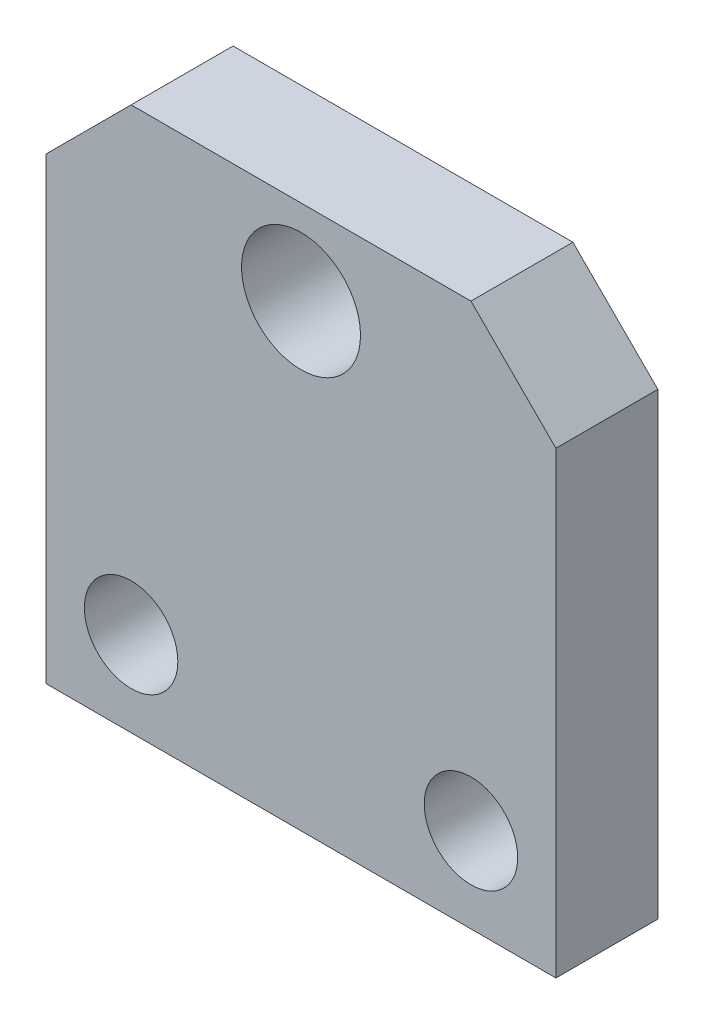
ISO-10303-21;
HEADER;
FILE_DESCRIPTION(('STEP AP214'),'2;1');
FILE_NAME('part.step','',(''),(''),'','','');
FILE_SCHEMA(('AUTOMOTIVE_DESIGN { 1 0 10303 214 1 1 1 1 }'));
ENDSEC;
DATA;
#1=APPLICATION_CONTEXT('core data for automotive mechanical design processes');
#2=APPLICATION_PROTOCOL_DEFINITION('international standard','automotive_design',2000,#1);
#3=PRODUCT_CONTEXT('',#1,'mechanical');
#4=PRODUCT('Part','Part','',(#3));
#5=PRODUCT_RELATED_PRODUCT_CATEGORY('part','',(#4));
#6=PRODUCT_DEFINITION_FORMATION('','',#4);
#7=PRODUCT_DEFINITION_CONTEXT('part definition',#1,'design');
#8=PRODUCT_DEFINITION('design','',#6,#7);
#9=PRODUCT_DEFINITION_SHAPE('','',#8);
#10=(LENGTH_UNIT() NAMED_UNIT(*) SI_UNIT(.MILLI.,.METRE.));
#11=(NAMED_UNIT(*) PLANE_ANGLE_UNIT() SI_UNIT($,.RADIAN.));
#12=(NAMED_UNIT(*) SI_UNIT($,.STERADIAN.) SOLID_ANGLE_UNIT());
#13=UNCERTAINTY_MEASURE_WITH_UNIT(LENGTH_MEASURE(1.E-05),#10,'distance_accuracy_value','');
#14=(GEOMETRIC_REPRESENTATION_CONTEXT(3) GLOBAL_UNCERTAINTY_ASSIGNED_CONTEXT((#13)) GLOBAL_UNIT_ASSIGNED_CONTEXT((#10,
#11,#12)) REPRESENTATION_CONTEXT('',''));
#15=CARTESIAN_POINT('',(0.,0.,0.));
#16=DIRECTION('',(0.,0.,1.));
#17=DIRECTION('',(1.,0.,0.));
#18=AXIS2_PLACEMENT_3D('',#15,#16,#17);
#19=CARTESIAN_POINT('',(0.,0.,8.));
#20=DIRECTION('',(0.,0.,1.));
#21=DIRECTION('',(1.,0.,0.));
#22=AXIS2_PLACEMENT_3D('',#19,#20,#21);
#23=PLANE('',#22);
#24=DIRECTION('',(0.,1.,0.));
#25=VECTOR('',#24,1.);
#26=CARTESIAN_POINT('',(-15.,16.,8.));
#27=LINE('',#26,#25);
#28=CARTESIAN_POINT('',(-15.,11.,8.));
#29=VERTEX_POINT('',#28);
#30=CARTESIAN_POINT('',(-15.,-16.,8.));
#31=VERTEX_POINT('',#30);
#32=EDGE_CURVE('E67',#29,#31,#27,.F.);
#33=ORIENTED_EDGE('',*,*,#32,.T.);
#34=DIRECTION('',(1.,0.,0.));
#35=VECTOR('',#34,1.);
#36=CARTESIAN_POINT('',(-25.,-16.,8.));
#37=LINE('',#36,#35);
#38=CARTESIAN_POINT('',(15.,-16.,8.));
#39=VERTEX_POINT('',#38);
#40=EDGE_CURVE('E262',#31,#39,#37,.T.);
#41=ORIENTED_EDGE('',*,*,#40,.T.);
#42=DIRECTION('',(0.,1.,0.));
#43=VECTOR('',#42,1.);
#44=CARTESIAN_POINT('',(15.,16.,8.));
#45=LINE('',#44,#43);
#46=CARTESIAN_POINT('',(15.,11.,8.));
#47=VERTEX_POINT('',#46);
#48=EDGE_CURVE('E268',#39,#47,#45,.T.);
#49=ORIENTED_EDGE('',*,*,#48,.T.);
#50=DIRECTION('',(0.707106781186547,-0.707106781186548,0.));
#51=VECTOR('',#50,1.);
#52=CARTESIAN_POINT('',(9.99999999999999,16.,8.));
#53=LINE('',#52,#51);
#54=CARTESIAN_POINT('',(9.99999999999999,16.,8.));
#55=VERTEX_POINT('',#54);
#56=EDGE_CURVE('E276',#47,#55,#53,.F.);
#57=ORIENTED_EDGE('',*,*,#56,.T.);
#58=DIRECTION('',(1.,0.,0.));
#59=VECTOR('',#58,1.);
#60=CARTESIAN_POINT('',(-25.,16.,8.));
#61=LINE('',#60,#59);
#62=CARTESIAN_POINT('',(-9.99999999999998,16.,8.));
#63=VERTEX_POINT('',#62);
#64=EDGE_CURVE('E72',#55,#63,#61,.F.);
#65=ORIENTED_EDGE('',*,*,#64,.T.);
#66=DIRECTION('',(0.707106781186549,0.707106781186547,0.));
#67=VECTOR('',#66,1.);
#68=CARTESIAN_POINT('',(-15.,11.,8.));
#69=LINE('',#68,#67);
#70=EDGE_CURVE('E70',#63,#29,#69,.F.);
#71=ORIENTED_EDGE('',*,*,#70,.T.);
#72=EDGE_LOOP('',(#33,#41,#49,#57,#65,#71));
#73=FACE_BOUND('',#72,.T.);
#74=CARTESIAN_POINT('',(-10.,-11.,8.));
#75=DIRECTION('',(0.,0.,1.));
#76=DIRECTION('',(1.,0.,0.));
#77=AXIS2_PLACEMENT_3D('',#74,#75,#76);
#78=CIRCLE('',#77,2.75);
#79=CARTESIAN_POINT('',(-7.25,-11.,8.));
#80=VERTEX_POINT('',#79);
#81=EDGE_CURVE('E78',#80,#80,#78,.F.);
#82=ORIENTED_EDGE('',*,*,#81,.T.);
#83=EDGE_LOOP('',(#82));
#84=FACE_BOUND('',#83,.T.);
#85=CARTESIAN_POINT('',(10.,-11.,8.));
#86=DIRECTION('',(0.,0.,1.));
#87=DIRECTION('',(1.,0.,0.));
#88=AXIS2_PLACEMENT_3D('',#85,#86,#87);
#89=CIRCLE('',#88,2.75);
#90=CARTESIAN_POINT('',(12.75,-11.,8.));
#91=VERTEX_POINT('',#90);
#92=EDGE_CURVE('E103',#91,#91,#89,.F.);
#93=ORIENTED_EDGE('',*,*,#92,.T.);
#94=EDGE_LOOP('',(#93));
#95=FACE_BOUND('',#94,.T.);
#96=CARTESIAN_POINT('',(0.,11.,8.));
#97=DIRECTION('',(0.,0.,1.));
#98=DIRECTION('',(1.,0.,0.));
#99=AXIS2_PLACEMENT_3D('',#96,#97,#98);
#100=CIRCLE('',#99,3.5);
#101=CARTESIAN_POINT('',(3.5,11.,8.));
#102=VERTEX_POINT('',#101);
#103=EDGE_CURVE('E20',#102,#102,#100,.F.);
#104=ORIENTED_EDGE('',*,*,#103,.T.);
#105=EDGE_LOOP('',(#104));
#106=FACE_BOUND('',#105,.T.);
#107=ADVANCED_FACE('F17',(#73,#84,#95,#106),#23,.T.);
#108=CARTESIAN_POINT('',(0.,11.,8.));
#109=DIRECTION('',(0.,0.,1.));
#110=DIRECTION('',(1.,0.,0.));
#111=AXIS2_PLACEMENT_3D('',#108,#109,#110);
#112=CYLINDRICAL_SURFACE('',#111,3.5);
#113=CARTESIAN_POINT('',(0.,11.,2.));
#114=DIRECTION('',(0.,0.,1.));
#115=DIRECTION('',(1.,0.,0.));
#116=AXIS2_PLACEMENT_3D('',#113,#114,#115);
#117=CIRCLE('',#116,3.5);
#118=CARTESIAN_POINT('',(3.5,11.,2.));
#119=VERTEX_POINT('',#118);
#120=EDGE_CURVE('E99',#119,#119,#117,.F.);
#121=ORIENTED_EDGE('',*,*,#120,.T.);
#122=EDGE_LOOP('',(#121));
#123=FACE_BOUND('',#122,.T.);
#124=ORIENTED_EDGE('',*,*,#103,.F.);
#125=EDGE_LOOP('',(#124));
#126=FACE_BOUND('',#125,.T.);
#127=ADVANCED_FACE('F111',(#123,#126),#112,.F.);
#128=CARTESIAN_POINT('',(10.,-11.,2.));
#129=DIRECTION('',(0.,0.,1.));
#130=DIRECTION('',(1.,0.,0.));
#131=AXIS2_PLACEMENT_3D('',#128,#129,#130);
#132=CYLINDRICAL_SURFACE('',#131,2.75);
#133=CARTESIAN_POINT('',(10.,-11.,2.));
#134=DIRECTION('',(0.,0.,1.));
#135=DIRECTION('',(1.,0.,0.));
#136=AXIS2_PLACEMENT_3D('',#133,#134,#135);
#137=CIRCLE('',#136,2.75);
#138=CARTESIAN_POINT('',(12.75,-11.,2.));
#139=VERTEX_POINT('',#138);
#140=EDGE_CURVE('E96',#139,#139,#137,.F.);
#141=ORIENTED_EDGE('',*,*,#140,.T.);
#142=EDGE_LOOP('',(#141));
#143=FACE_BOUND('',#142,.T.);
#144=ORIENTED_EDGE('',*,*,#92,.F.);
#145=EDGE_LOOP('',(#144));
#146=FACE_BOUND('',#145,.T.);
#147=ADVANCED_FACE('F113',(#143,#146),#132,.F.);
#148=CARTESIAN_POINT('',(-10.,-11.,2.));
#149=DIRECTION('',(0.,0.,1.));
#150=DIRECTION('',(1.,0.,0.));
#151=AXIS2_PLACEMENT_3D('',#148,#149,#150);
#152=CYLINDRICAL_SURFACE('',#151,2.75);
#153=CARTESIAN_POINT('',(-10.,-11.,2.));
#154=DIRECTION('',(0.,0.,1.));
#155=DIRECTION('',(1.,0.,0.));
#156=AXIS2_PLACEMENT_3D('',#153,#154,#155);
#157=CIRCLE('',#156,2.75);
#158=CARTESIAN_POINT('',(-7.25,-11.,2.));
#159=VERTEX_POINT('',#158);
#160=EDGE_CURVE('E93',#159,#159,#157,.F.);
#161=ORIENTED_EDGE('',*,*,#160,.T.);
#162=EDGE_LOOP('',(#161));
#163=FACE_BOUND('',#162,.T.);
#164=ORIENTED_EDGE('',*,*,#81,.F.);
#165=EDGE_LOOP('',(#164));
#166=FACE_BOUND('',#165,.T.);
#167=ADVANCED_FACE('F120',(#163,#166),#152,.F.);
#168=CARTESIAN_POINT('',(-15.,11.,8.));
#169=DIRECTION('',(0.707106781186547,-0.707106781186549,0.));
#170=DIRECTION('',(0.707106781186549,0.707106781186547,0.));
#171=AXIS2_PLACEMENT_3D('',#168,#169,#170);
#172=PLANE('',#171);
#173=DIRECTION('',(0.,0.,-1.));
#174=VECTOR('',#173,1.);
#175=CARTESIAN_POINT('',(-9.99999999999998,16.,8.));
#176=LINE('',#175,#174);
#177=CARTESIAN_POINT('',(-9.99999999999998,16.,2.));
#178=VERTEX_POINT('',#177);
#179=EDGE_CURVE('E278',#63,#178,#176,.T.);
#180=ORIENTED_EDGE('',*,*,#179,.T.);
#181=DIRECTION('',(-0.707106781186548,-0.707106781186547,0.));
#182=VECTOR('',#181,1.);
#183=CARTESIAN_POINT('',(-9.99999999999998,16.,2.));
#184=LINE('',#183,#182);
#185=CARTESIAN_POINT('',(-15.,11.,2.));
#186=VERTEX_POINT('',#185);
#187=EDGE_CURVE('E89',#178,#186,#184,.T.);
#188=ORIENTED_EDGE('',*,*,#187,.T.);
#189=DIRECTION('',(0.,0.,-1.));
#190=VECTOR('',#189,1.);
#191=CARTESIAN_POINT('',(-15.,11.,8.));
#192=LINE('',#191,#190);
#193=EDGE_CURVE('E77',#186,#29,#192,.F.);
#194=ORIENTED_EDGE('',*,*,#193,.T.);
#195=ORIENTED_EDGE('',*,*,#70,.F.);
#196=EDGE_LOOP('',(#180,#188,#194,#195));
#197=FACE_BOUND('',#196,.T.);
#198=ADVANCED_FACE('F88',(#197),#172,.F.);
#199=CARTESIAN_POINT('',(-15.,16.,8.));
#200=DIRECTION('',(1.,0.,0.));
#201=DIRECTION('',(0.,0.,-1.));
#202=AXIS2_PLACEMENT_3D('',#199,#200,#201);
#203=PLANE('',#202);
#204=ORIENTED_EDGE('',*,*,#193,.F.);
#205=DIRECTION('',(0.,1.,0.));
#206=VECTOR('',#205,1.);
#207=CARTESIAN_POINT('',(-15.,-16.,2.));
#208=LINE('',#207,#206);
#209=CARTESIAN_POINT('',(-15.,-16.,2.));
#210=VERTEX_POINT('',#209);
#211=EDGE_CURVE('E283',#186,#210,#208,.F.);
#212=ORIENTED_EDGE('',*,*,#211,.T.);
#213=DIRECTION('',(0.,0.,1.));
#214=VECTOR('',#213,1.);
#215=CARTESIAN_POINT('',(-15.,-16.,8.));
#216=LINE('',#215,#214);
#217=EDGE_CURVE('E85',#210,#31,#216,.T.);
#218=ORIENTED_EDGE('',*,*,#217,.T.);
#219=ORIENTED_EDGE('',*,*,#32,.F.);
#220=EDGE_LOOP('',(#204,#212,#218,#219));
#221=FACE_BOUND('',#220,.T.);
#222=ADVANCED_FACE('F82',(#221),#203,.F.);
#223=CARTESIAN_POINT('',(-25.,-16.,8.));
#224=DIRECTION('',(0.,1.,0.));
#225=DIRECTION('',(0.,0.,1.));
#226=AXIS2_PLACEMENT_3D('',#223,#224,#225);
#227=PLANE('',#226);
#228=DIRECTION('',(0.,0.,1.));
#229=VECTOR('',#228,1.);
#230=CARTESIAN_POINT('',(15.,-16.,8.));
#231=LINE('',#230,#229);
#232=CARTESIAN_POINT('',(15.,-16.,2.));
#233=VERTEX_POINT('',#232);
#234=EDGE_CURVE('E261',#233,#39,#231,.T.);
#235=ORIENTED_EDGE('',*,*,#234,.T.);
#236=ORIENTED_EDGE('',*,*,#40,.F.);
#237=ORIENTED_EDGE('',*,*,#217,.F.);
#238=DIRECTION('',(1.,0.,0.));
#239=VECTOR('',#238,1.);
#240=CARTESIAN_POINT('',(-15.,-16.,2.));
#241=LINE('',#240,#239);
#242=EDGE_CURVE('E264',#210,#233,#241,.T.);
#243=ORIENTED_EDGE('',*,*,#242,.T.);
#244=EDGE_LOOP('',(#235,#236,#237,#243));
#245=FACE_BOUND('',#244,.T.);
#246=ADVANCED_FACE('F142',(#245),#227,.F.);
#247=CARTESIAN_POINT('',(15.,16.,8.));
#248=DIRECTION('',(-1.,0.,0.));
#249=DIRECTION('',(0.,0.,1.));
#250=AXIS2_PLACEMENT_3D('',#247,#248,#249);
#251=PLANE('',#250);
#252=DIRECTION('',(0.,0.,1.));
#253=VECTOR('',#252,1.);
#254=CARTESIAN_POINT('',(15.,11.,8.));
#255=LINE('',#254,#253);
#256=CARTESIAN_POINT('',(15.,11.,2.));
#257=VERTEX_POINT('',#256);
#258=EDGE_CURVE('E270',#257,#47,#255,.T.);
#259=ORIENTED_EDGE('',*,*,#258,.T.);
#260=ORIENTED_EDGE('',*,*,#48,.F.);
#261=ORIENTED_EDGE('',*,*,#234,.F.);
#262=DIRECTION('',(0.,1.,0.));
#263=VECTOR('',#262,1.);
#264=CARTESIAN_POINT('',(15.,-16.,2.));
#265=LINE('',#264,#263);
#266=EDGE_CURVE('E286',#233,#257,#265,.T.);
#267=ORIENTED_EDGE('',*,*,#266,.T.);
#268=EDGE_LOOP('',(#259,#260,#261,#267));
#269=FACE_BOUND('',#268,.T.);
#270=ADVANCED_FACE('F138',(#269),#251,.F.);
#271=CARTESIAN_POINT('',(9.99999999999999,16.,8.));
#272=DIRECTION('',(-0.707106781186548,-0.707106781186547,0.));
#273=DIRECTION('',(0.707106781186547,-0.707106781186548,0.));
#274=AXIS2_PLACEMENT_3D('',#271,#272,#273);
#275=PLANE('',#274);
#276=ORIENTED_EDGE('',*,*,#258,.F.);
#277=DIRECTION('',(-0.707106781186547,0.707106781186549,0.));
#278=VECTOR('',#277,1.);
#279=CARTESIAN_POINT('',(15.,11.,2.));
#280=LINE('',#279,#278);
#281=CARTESIAN_POINT('',(9.99999999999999,16.,2.));
#282=VERTEX_POINT('',#281);
#283=EDGE_CURVE('E26',#257,#282,#280,.T.);
#284=ORIENTED_EDGE('',*,*,#283,.T.);
#285=DIRECTION('',(0.,0.,-1.));
#286=VECTOR('',#285,1.);
#287=CARTESIAN_POINT('',(9.99999999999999,16.,8.));
#288=LINE('',#287,#286);
#289=EDGE_CURVE('E34',#282,#55,#288,.F.);
#290=ORIENTED_EDGE('',*,*,#289,.T.);
#291=ORIENTED_EDGE('',*,*,#56,.F.);
#292=EDGE_LOOP('',(#276,#284,#290,#291));
#293=FACE_BOUND('',#292,.T.);
#294=ADVANCED_FACE('F131',(#293),#275,.F.);
#295=CARTESIAN_POINT('',(-25.,16.,8.));
#296=DIRECTION('',(0.,-1.,0.));
#297=DIRECTION('',(0.,0.,-1.));
#298=AXIS2_PLACEMENT_3D('',#295,#296,#297);
#299=PLANE('',#298);
#300=ORIENTED_EDGE('',*,*,#289,.F.);
#301=DIRECTION('',(1.,0.,0.));
#302=VECTOR('',#301,1.);
#303=CARTESIAN_POINT('',(-15.,16.,2.));
#304=LINE('',#303,#302);
#305=EDGE_CURVE('E11',#282,#178,#304,.F.);
#306=ORIENTED_EDGE('',*,*,#305,.T.);
#307=ORIENTED_EDGE('',*,*,#179,.F.);
#308=ORIENTED_EDGE('',*,*,#64,.F.);
#309=EDGE_LOOP('',(#300,#306,#307,#308));
#310=FACE_BOUND('',#309,.T.);
#311=ADVANCED_FACE('F125',(#310),#299,.F.);
#312=CARTESIAN_POINT('',(-15.,-16.,2.));
#313=DIRECTION('',(0.,0.,1.));
#314=DIRECTION('',(1.,0.,0.));
#315=AXIS2_PLACEMENT_3D('',#312,#313,#314);
#316=PLANE('',#315);
#317=ORIENTED_EDGE('',*,*,#283,.F.);
#318=ORIENTED_EDGE('',*,*,#266,.F.);
#319=ORIENTED_EDGE('',*,*,#242,.F.);
#320=ORIENTED_EDGE('',*,*,#211,.F.);
#321=ORIENTED_EDGE('',*,*,#187,.F.);
#322=ORIENTED_EDGE('',*,*,#305,.F.);
#323=EDGE_LOOP('',(#317,#318,#319,#320,#321,#322));
#324=FACE_BOUND('',#323,.T.);
#325=ORIENTED_EDGE('',*,*,#160,.F.);
#326=EDGE_LOOP('',(#325));
#327=FACE_BOUND('',#326,.T.);
#328=ORIENTED_EDGE('',*,*,#140,.F.);
#329=EDGE_LOOP('',(#328));
#330=FACE_BOUND('',#329,.T.);
#331=ORIENTED_EDGE('',*,*,#120,.F.);
#332=EDGE_LOOP('',(#331));
#333=FACE_BOUND('',#332,.T.);
#334=ADVANCED_FACE('F123',(#324,#327,#330,#333),#316,.F.);
#335=CLOSED_SHELL('',(#107,#127,#147,#167,#198,#222,#246,#270,#294,#311,#334));
#336=MANIFOLD_SOLID_BREP('B1',#335);
#337=ADVANCED_BREP_SHAPE_REPRESENTATION('',(#18,#336),#14);
#338=SHAPE_DEFINITION_REPRESENTATION(#9,#337);
ENDSEC;
END-ISO-10303-21;
